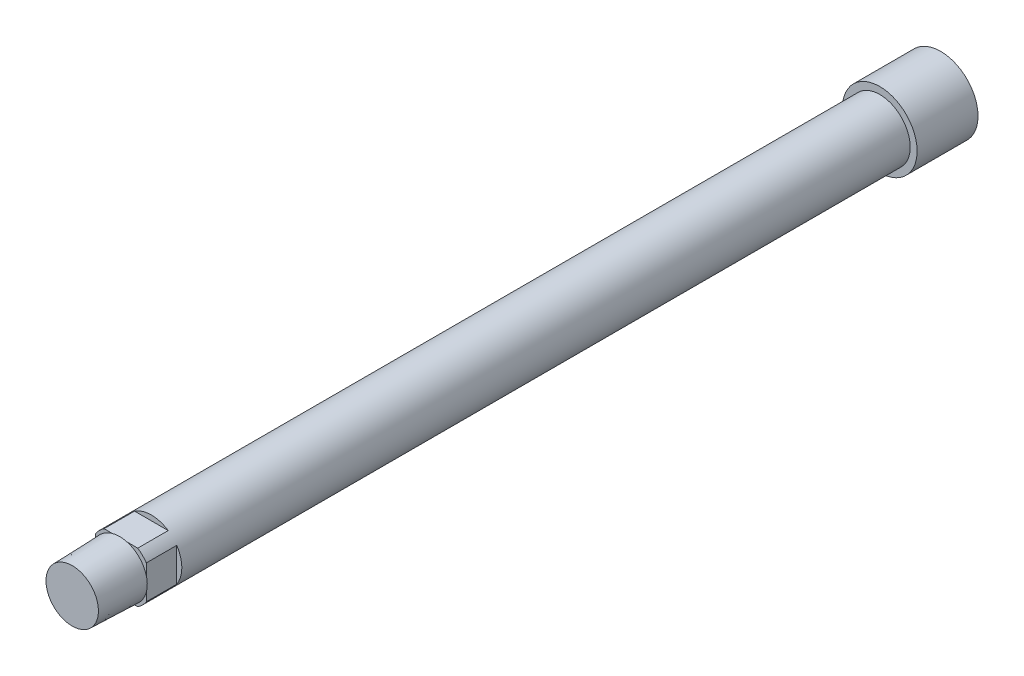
ISO-10303-21;
HEADER;
FILE_DESCRIPTION(('STEP AP214'),'2;1');
FILE_NAME('part.step','',(''),(''),'','','');
FILE_SCHEMA(('AUTOMOTIVE_DESIGN { 1 0 10303 214 1 1 1 1 }'));
ENDSEC;
DATA;
#1=APPLICATION_CONTEXT('core data for automotive mechanical design processes');
#2=APPLICATION_PROTOCOL_DEFINITION('international standard','automotive_design',2000,#1);
#3=PRODUCT_CONTEXT('',#1,'mechanical');
#4=PRODUCT('Part','Part','',(#3));
#5=PRODUCT_RELATED_PRODUCT_CATEGORY('part','',(#4));
#6=PRODUCT_DEFINITION_FORMATION('','',#4);
#7=PRODUCT_DEFINITION_CONTEXT('part definition',#1,'design');
#8=PRODUCT_DEFINITION('design','',#6,#7);
#9=PRODUCT_DEFINITION_SHAPE('','',#8);
#10=(LENGTH_UNIT() NAMED_UNIT(*) SI_UNIT(.MILLI.,.METRE.));
#11=(NAMED_UNIT(*) PLANE_ANGLE_UNIT() SI_UNIT($,.RADIAN.));
#12=(NAMED_UNIT(*) SI_UNIT($,.STERADIAN.) SOLID_ANGLE_UNIT());
#13=UNCERTAINTY_MEASURE_WITH_UNIT(LENGTH_MEASURE(1.E-05),#10,'distance_accuracy_value','');
#14=(GEOMETRIC_REPRESENTATION_CONTEXT(3) GLOBAL_UNCERTAINTY_ASSIGNED_CONTEXT((#13)) GLOBAL_UNIT_ASSIGNED_CONTEXT((#10,
#11,#12)) REPRESENTATION_CONTEXT('',''));
#15=CARTESIAN_POINT('',(0.,0.,0.));
#16=DIRECTION('',(0.,0.,1.));
#17=DIRECTION('',(1.,0.,0.));
#18=AXIS2_PLACEMENT_3D('',#15,#16,#17);
#19=CARTESIAN_POINT('',(0.,0.,227.8634));
#20=DIRECTION('',(0.,0.,1.));
#21=DIRECTION('',(1.,0.,0.));
#22=AXIS2_PLACEMENT_3D('',#19,#20,#21);
#23=PLANE('',#22);
#24=CARTESIAN_POINT('',(0.,0.,227.8634));
#25=DIRECTION('',(0.,0.,1.));
#26=DIRECTION('',(1.,0.,0.));
#27=AXIS2_PLACEMENT_3D('',#24,#25,#26);
#28=CIRCLE('',#27,9.525);
#29=CARTESIAN_POINT('',(-7.9375,5.2651418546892,227.8634));
#30=VERTEX_POINT('',#29);
#31=CARTESIAN_POINT('',(-7.9375,-5.2651418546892,227.8634));
#32=VERTEX_POINT('',#31);
#33=EDGE_CURVE('E11',#30,#32,#28,.T.);
#34=ORIENTED_EDGE('',*,*,#33,.T.);
#35=DIRECTION('',(0.,-1.,0.));
#36=VECTOR('',#35,1.);
#37=CARTESIAN_POINT('',(-7.9375,-7.93750000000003,227.8634));
#38=LINE('',#37,#36);
#39=EDGE_CURVE('E129',#30,#32,#38,.T.);
#40=ORIENTED_EDGE('',*,*,#39,.F.);
#41=EDGE_LOOP('',(#34,#40));
#42=FACE_BOUND('',#41,.T.);
#43=ADVANCED_FACE('F41',(#42),#23,.T.);
#44=CARTESIAN_POINT('',(-5.26514185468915,-7.93750000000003,227.8634));
#45=VERTEX_POINT('',#44);
#46=CARTESIAN_POINT('',(5.26514185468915,-7.93750000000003,227.8634));
#47=VERTEX_POINT('',#46);
#48=EDGE_CURVE('E45',#45,#47,#28,.T.);
#49=ORIENTED_EDGE('',*,*,#48,.T.);
#50=DIRECTION('',(1.,0.,0.));
#51=VECTOR('',#50,1.);
#52=CARTESIAN_POINT('',(-7.9375,-7.93750000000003,227.8634));
#53=LINE('',#52,#51);
#54=EDGE_CURVE('E184',#45,#47,#53,.T.);
#55=ORIENTED_EDGE('',*,*,#54,.F.);
#56=EDGE_LOOP('',(#49,#55));
#57=FACE_BOUND('',#56,.T.);
#58=ADVANCED_FACE('F226',(#57),#23,.T.);
#59=CARTESIAN_POINT('',(7.9375,-5.2651418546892,227.8634));
#60=VERTEX_POINT('',#59);
#61=CARTESIAN_POINT('',(7.9375,5.2651418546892,227.8634));
#62=VERTEX_POINT('',#61);
#63=EDGE_CURVE('E144',#60,#62,#28,.T.);
#64=ORIENTED_EDGE('',*,*,#63,.T.);
#65=DIRECTION('',(0.,1.,0.));
#66=VECTOR('',#65,1.);
#67=CARTESIAN_POINT('',(7.9375,-7.93750000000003,227.8634));
#68=LINE('',#67,#66);
#69=EDGE_CURVE('E181',#60,#62,#68,.T.);
#70=ORIENTED_EDGE('',*,*,#69,.F.);
#71=EDGE_LOOP('',(#64,#70));
#72=FACE_BOUND('',#71,.T.);
#73=ADVANCED_FACE('F232',(#72),#23,.T.);
#74=CARTESIAN_POINT('',(5.26514185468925,7.93749999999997,227.8634));
#75=VERTEX_POINT('',#74);
#76=CARTESIAN_POINT('',(-5.26514185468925,7.93749999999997,227.8634));
#77=VERTEX_POINT('',#76);
#78=EDGE_CURVE('E50',#75,#77,#28,.T.);
#79=ORIENTED_EDGE('',*,*,#78,.T.);
#80=DIRECTION('',(-1.,0.,0.));
#81=VECTOR('',#80,1.);
#82=CARTESIAN_POINT('',(-7.9375,7.93749999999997,227.8634));
#83=LINE('',#82,#81);
#84=EDGE_CURVE('E178',#75,#77,#83,.T.);
#85=ORIENTED_EDGE('',*,*,#84,.F.);
#86=EDGE_LOOP('',(#79,#85));
#87=FACE_BOUND('',#86,.T.);
#88=ADVANCED_FACE('F228',(#87),#23,.T.);
#89=CARTESIAN_POINT('',(-7.9375,-7.93750000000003,227.8634));
#90=DIRECTION('',(-1.,0.,0.));
#91=DIRECTION('',(0.,0.,1.));
#92=AXIS2_PLACEMENT_3D('',#89,#90,#91);
#93=PLANE('',#92);
#94=DIRECTION('',(0.,0.,-1.));
#95=VECTOR('',#94,1.);
#96=CARTESIAN_POINT('',(-7.9375,5.2651418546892,252.6284));
#97=LINE('',#96,#95);
#98=CARTESIAN_POINT('',(-7.9375,5.26514185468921,237.3884));
#99=VERTEX_POINT('',#98);
#100=EDGE_CURVE('E160',#99,#30,#97,.T.);
#101=ORIENTED_EDGE('',*,*,#100,.T.);
#102=ORIENTED_EDGE('',*,*,#39,.T.);
#103=DIRECTION('',(0.,0.,-1.));
#104=VECTOR('',#103,1.);
#105=CARTESIAN_POINT('',(-7.9375,-5.2651418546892,252.6284));
#106=LINE('',#105,#104);
#107=CARTESIAN_POINT('',(-7.9375,-5.26514185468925,237.3884));
#108=VERTEX_POINT('',#107);
#109=EDGE_CURVE('E137',#32,#108,#106,.F.);
#110=ORIENTED_EDGE('',*,*,#109,.T.);
#111=DIRECTION('',(0.,-1.,0.));
#112=VECTOR('',#111,1.);
#113=CARTESIAN_POINT('',(-7.9375,9.525,237.3884));
#114=LINE('',#113,#112);
#115=CARTESIAN_POINT('',(-7.9375,0.,237.3884));
#116=VERTEX_POINT('',#115);
#117=EDGE_CURVE('E64',#116,#108,#114,.T.);
#118=ORIENTED_EDGE('',*,*,#117,.F.);
#119=EDGE_CURVE('E133',#99,#116,#114,.T.);
#120=ORIENTED_EDGE('',*,*,#119,.F.);
#121=EDGE_LOOP('',(#101,#102,#110,#118,#120));
#122=FACE_BOUND('',#121,.T.);
#123=ADVANCED_FACE('F132',(#122),#93,.T.);
#124=CARTESIAN_POINT('',(-7.9375,7.93749999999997,227.8634));
#125=DIRECTION('',(0.,1.,0.));
#126=DIRECTION('',(0.,0.,1.));
#127=AXIS2_PLACEMENT_3D('',#124,#125,#126);
#128=PLANE('',#127);
#129=DIRECTION('',(0.,0.,-1.));
#130=VECTOR('',#129,1.);
#131=CARTESIAN_POINT('',(5.26514185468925,7.93749999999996,252.6284));
#132=LINE('',#131,#130);
#133=CARTESIAN_POINT('',(5.26514185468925,7.93749999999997,237.3884));
#134=VERTEX_POINT('',#133);
#135=EDGE_CURVE('E163',#134,#75,#132,.T.);
#136=ORIENTED_EDGE('',*,*,#135,.T.);
#137=ORIENTED_EDGE('',*,*,#84,.T.);
#138=DIRECTION('',(0.,0.,-1.));
#139=VECTOR('',#138,1.);
#140=CARTESIAN_POINT('',(-5.26514185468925,7.93749999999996,252.6284));
#141=LINE('',#140,#139);
#142=CARTESIAN_POINT('',(-5.26514185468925,7.93749999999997,237.3884));
#143=VERTEX_POINT('',#142);
#144=EDGE_CURVE('E165',#77,#143,#141,.F.);
#145=ORIENTED_EDGE('',*,*,#144,.T.);
#146=DIRECTION('',(-1.,0.,0.));
#147=VECTOR('',#146,1.);
#148=CARTESIAN_POINT('',(0.,7.93749999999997,237.3884));
#149=LINE('',#148,#147);
#150=CARTESIAN_POINT('',(0.,7.93749999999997,237.3884));
#151=VERTEX_POINT('',#150);
#152=EDGE_CURVE('E148',#151,#143,#149,.T.);
#153=ORIENTED_EDGE('',*,*,#152,.F.);
#154=EDGE_CURVE('E139',#134,#151,#149,.T.);
#155=ORIENTED_EDGE('',*,*,#154,.F.);
#156=EDGE_LOOP('',(#136,#137,#145,#153,#155));
#157=FACE_BOUND('',#156,.T.);
#158=ADVANCED_FACE('F242',(#157),#128,.T.);
#159=CARTESIAN_POINT('',(-7.9375,-7.93750000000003,227.8634));
#160=DIRECTION('',(0.,-1.,0.));
#161=DIRECTION('',(0.,0.,-1.));
#162=AXIS2_PLACEMENT_3D('',#159,#160,#161);
#163=PLANE('',#162);
#164=DIRECTION('',(0.,0.,-1.));
#165=VECTOR('',#164,1.);
#166=CARTESIAN_POINT('',(-5.26514185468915,-7.93750000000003,252.6284));
#167=LINE('',#166,#165);
#168=CARTESIAN_POINT('',(-5.26514185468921,-7.93750000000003,237.3884));
#169=VERTEX_POINT('',#168);
#170=EDGE_CURVE('E173',#169,#45,#167,.T.);
#171=ORIENTED_EDGE('',*,*,#170,.T.);
#172=ORIENTED_EDGE('',*,*,#54,.T.);
#173=DIRECTION('',(0.,0.,-1.));
#174=VECTOR('',#173,1.);
#175=CARTESIAN_POINT('',(5.26514185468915,-7.93750000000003,252.6284));
#176=LINE('',#175,#174);
#177=CARTESIAN_POINT('',(5.26514185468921,-7.93750000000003,237.3884));
#178=VERTEX_POINT('',#177);
#179=EDGE_CURVE('E175',#47,#178,#176,.F.);
#180=ORIENTED_EDGE('',*,*,#179,.T.);
#181=DIRECTION('',(1.,0.,0.));
#182=VECTOR('',#181,1.);
#183=CARTESIAN_POINT('',(0.,-7.93750000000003,237.3884));
#184=LINE('',#183,#182);
#185=CARTESIAN_POINT('',(0.,-7.93750000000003,237.3884));
#186=VERTEX_POINT('',#185);
#187=EDGE_CURVE('E154',#186,#178,#184,.T.);
#188=ORIENTED_EDGE('',*,*,#187,.F.);
#189=EDGE_CURVE('E128',#169,#186,#184,.T.);
#190=ORIENTED_EDGE('',*,*,#189,.F.);
#191=EDGE_LOOP('',(#171,#172,#180,#188,#190));
#192=FACE_BOUND('',#191,.T.);
#193=ADVANCED_FACE('F259',(#192),#163,.T.);
#194=CARTESIAN_POINT('',(7.9375,-7.93750000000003,227.8634));
#195=DIRECTION('',(1.,0.,0.));
#196=DIRECTION('',(0.,0.,-1.));
#197=AXIS2_PLACEMENT_3D('',#194,#195,#196);
#198=PLANE('',#197);
#199=DIRECTION('',(0.,0.,-1.));
#200=VECTOR('',#199,1.);
#201=CARTESIAN_POINT('',(7.9375,-5.2651418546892,252.6284));
#202=LINE('',#201,#200);
#203=CARTESIAN_POINT('',(7.9375,-5.26514185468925,237.3884));
#204=VERTEX_POINT('',#203);
#205=EDGE_CURVE('E168',#204,#60,#202,.T.);
#206=ORIENTED_EDGE('',*,*,#205,.T.);
#207=ORIENTED_EDGE('',*,*,#69,.T.);
#208=DIRECTION('',(0.,0.,-1.));
#209=VECTOR('',#208,1.);
#210=CARTESIAN_POINT('',(7.9375,5.2651418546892,252.6284));
#211=LINE('',#210,#209);
#212=CARTESIAN_POINT('',(7.9375,5.26514185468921,237.3884));
#213=VERTEX_POINT('',#212);
#214=EDGE_CURVE('E170',#62,#213,#211,.F.);
#215=ORIENTED_EDGE('',*,*,#214,.T.);
#216=DIRECTION('',(0.,1.,0.));
#217=VECTOR('',#216,1.);
#218=CARTESIAN_POINT('',(7.9375,9.525,237.3884));
#219=LINE('',#218,#217);
#220=CARTESIAN_POINT('',(7.9375,0.,237.3884));
#221=VERTEX_POINT('',#220);
#222=EDGE_CURVE('E152',#221,#213,#219,.T.);
#223=ORIENTED_EDGE('',*,*,#222,.F.);
#224=EDGE_CURVE('E149',#204,#221,#219,.T.);
#225=ORIENTED_EDGE('',*,*,#224,.F.);
#226=EDGE_LOOP('',(#206,#207,#215,#223,#225));
#227=FACE_BOUND('',#226,.T.);
#228=ADVANCED_FACE('F265',(#227),#198,.T.);
#229=CARTESIAN_POINT('',(0.,9.525,237.3884));
#230=DIRECTION('',(0.,0.,1.));
#231=DIRECTION('',(0.,-1.,0.));
#232=AXIS2_PLACEMENT_3D('',#229,#230,#231);
#233=PLANE('',#232);
#234=ORIENTED_EDGE('',*,*,#189,.T.);
#235=CARTESIAN_POINT('',(0.,0.,237.3884));
#236=DIRECTION('',(0.,0.,1.));
#237=DIRECTION('',(0.,-1.,0.));
#238=AXIS2_PLACEMENT_3D('',#235,#236,#237);
#239=CIRCLE('',#238,7.93749999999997);
#240=EDGE_CURVE('E57',#186,#116,#239,.F.);
#241=ORIENTED_EDGE('',*,*,#240,.T.);
#242=ORIENTED_EDGE('',*,*,#117,.T.);
#243=CARTESIAN_POINT('',(0.,0.,237.3884));
#244=DIRECTION('',(0.,0.,1.));
#245=DIRECTION('',(0.,-1.,0.));
#246=AXIS2_PLACEMENT_3D('',#243,#244,#245);
#247=CIRCLE('',#246,9.52500000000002);
#248=EDGE_CURVE('E159',#108,#169,#247,.T.);
#249=ORIENTED_EDGE('',*,*,#248,.T.);
#250=EDGE_LOOP('',(#234,#241,#242,#249));
#251=FACE_BOUND('',#250,.T.);
#252=ADVANCED_FACE('F127',(#251),#233,.T.);
#253=ORIENTED_EDGE('',*,*,#224,.T.);
#254=EDGE_CURVE('E130',#221,#186,#239,.F.);
#255=ORIENTED_EDGE('',*,*,#254,.T.);
#256=ORIENTED_EDGE('',*,*,#187,.T.);
#257=EDGE_CURVE('E155',#178,#204,#247,.T.);
#258=ORIENTED_EDGE('',*,*,#257,.T.);
#259=EDGE_LOOP('',(#253,#255,#256,#258));
#260=FACE_BOUND('',#259,.T.);
#261=ADVANCED_FACE('F263',(#260),#233,.T.);
#262=ORIENTED_EDGE('',*,*,#154,.T.);
#263=EDGE_CURVE('E121',#151,#221,#239,.F.);
#264=ORIENTED_EDGE('',*,*,#263,.T.);
#265=ORIENTED_EDGE('',*,*,#222,.T.);
#266=EDGE_CURVE('E158',#213,#134,#247,.T.);
#267=ORIENTED_EDGE('',*,*,#266,.T.);
#268=EDGE_LOOP('',(#262,#264,#265,#267));
#269=FACE_BOUND('',#268,.T.);
#270=ADVANCED_FACE('F252',(#269),#233,.T.);
#271=ORIENTED_EDGE('',*,*,#119,.T.);
#272=EDGE_CURVE('E117',#116,#151,#239,.F.);
#273=ORIENTED_EDGE('',*,*,#272,.T.);
#274=ORIENTED_EDGE('',*,*,#152,.T.);
#275=EDGE_CURVE('E143',#143,#99,#247,.T.);
#276=ORIENTED_EDGE('',*,*,#275,.T.);
#277=EDGE_LOOP('',(#271,#273,#274,#276));
#278=FACE_BOUND('',#277,.T.);
#279=ADVANCED_FACE('F141',(#278),#233,.T.);
#280=CARTESIAN_POINT('',(0.,0.,252.6284));
#281=DIRECTION('',(0.,0.,-1.));
#282=DIRECTION('',(-1.,0.,0.));
#283=AXIS2_PLACEMENT_3D('',#280,#281,#282);
#284=CYLINDRICAL_SURFACE('',#283,9.525);
#285=CARTESIAN_POINT('',(0.,0.,0.));
#286=DIRECTION('',(0.,0.,-1.));
#287=DIRECTION('',(-1.,0.,0.));
#288=AXIS2_PLACEMENT_3D('',#285,#286,#287);
#289=CIRCLE('',#288,9.525);
#290=CARTESIAN_POINT('',(-9.525,0.,0.));
#291=VERTEX_POINT('',#290);
#292=EDGE_CURVE('E194',#291,#291,#289,.T.);
#293=ORIENTED_EDGE('',*,*,#292,.F.);
#294=EDGE_LOOP('',(#293));
#295=FACE_BOUND('',#294,.T.);
#296=ORIENTED_EDGE('',*,*,#100,.F.);
#297=ORIENTED_EDGE('',*,*,#275,.F.);
#298=ORIENTED_EDGE('',*,*,#144,.F.);
#299=ORIENTED_EDGE('',*,*,#78,.F.);
#300=ORIENTED_EDGE('',*,*,#135,.F.);
#301=ORIENTED_EDGE('',*,*,#266,.F.);
#302=ORIENTED_EDGE('',*,*,#214,.F.);
#303=ORIENTED_EDGE('',*,*,#63,.F.);
#304=ORIENTED_EDGE('',*,*,#205,.F.);
#305=ORIENTED_EDGE('',*,*,#257,.F.);
#306=ORIENTED_EDGE('',*,*,#179,.F.);
#307=ORIENTED_EDGE('',*,*,#48,.F.);
#308=ORIENTED_EDGE('',*,*,#170,.F.);
#309=ORIENTED_EDGE('',*,*,#248,.F.);
#310=ORIENTED_EDGE('',*,*,#109,.F.);
#311=ORIENTED_EDGE('',*,*,#33,.F.);
#312=EDGE_LOOP('',(#296,#297,#298,#299,#300,#301,#302,#303,#304,#305,#306,#307,#308,#309,#310,#311));
#313=FACE_BOUND('',#312,.T.);
#314=ADVANCED_FACE('F43',(#295,#313),#284,.T.);
#315=CARTESIAN_POINT('',(0.,0.,236.470198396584));
#316=DIRECTION('',(0.,0.,1.));
#317=DIRECTION('',(0.,-1.,0.));
#318=AXIS2_PLACEMENT_3D('',#315,#316,#317);
#319=CONICAL_SURFACE('',#318,6.35,1.04641457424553);
#320=ORIENTED_EDGE('',*,*,#240,.F.);
#321=ORIENTED_EDGE('',*,*,#254,.F.);
#322=ORIENTED_EDGE('',*,*,#263,.F.);
#323=ORIENTED_EDGE('',*,*,#272,.F.);
#324=EDGE_LOOP('',(#320,#321,#322,#323));
#325=FACE_BOUND('',#324,.T.);
#326=CARTESIAN_POINT('',(0.,0.,237.808996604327));
#327=DIRECTION('',(0.,0.,1.));
#328=DIRECTION('',(0.,-1.,0.));
#329=AXIS2_PLACEMENT_3D('',#326,#327,#328);
#330=CIRCLE('',#329,8.66467920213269);
#331=CARTESIAN_POINT('',(0.,-8.66467920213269,237.808996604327));
#332=VERTEX_POINT('',#331);
#333=EDGE_CURVE('E188',#332,#332,#330,.T.);
#334=ORIENTED_EDGE('',*,*,#333,.F.);
#335=EDGE_LOOP('',(#334));
#336=FACE_BOUND('',#335,.T.);
#337=ADVANCED_FACE('F118',(#325,#336),#319,.T.);
#338=CARTESIAN_POINT('',(0.,0.,252.6284));
#339=DIRECTION('',(0.,0.,-1.));
#340=DIRECTION('',(0.,1.,0.));
#341=AXIS2_PLACEMENT_3D('',#338,#339,#340);
#342=CONICAL_SURFACE('',#341,8.20413868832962,0.0310668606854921);
#343=ORIENTED_EDGE('',*,*,#333,.T.);
#344=EDGE_LOOP('',(#343));
#345=FACE_BOUND('',#344,.T.);
#346=CARTESIAN_POINT('',(0.,0.,252.6284));
#347=DIRECTION('',(0.,0.,1.));
#348=DIRECTION('',(0.,-1.,0.));
#349=AXIS2_PLACEMENT_3D('',#346,#347,#348);
#350=CIRCLE('',#349,8.20413868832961);
#351=CARTESIAN_POINT('',(0.,-8.20413868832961,252.6284));
#352=VERTEX_POINT('',#351);
#353=EDGE_CURVE('E191',#352,#352,#350,.T.);
#354=ORIENTED_EDGE('',*,*,#353,.F.);
#355=EDGE_LOOP('',(#354));
#356=FACE_BOUND('',#355,.T.);
#357=ADVANCED_FACE('F281',(#345,#356),#342,.T.);
#358=CARTESIAN_POINT('',(0.,0.,252.6284));
#359=DIRECTION('',(0.,0.,1.));
#360=DIRECTION('',(1.,0.,0.));
#361=AXIS2_PLACEMENT_3D('',#358,#359,#360);
#362=PLANE('',#361);
#363=ORIENTED_EDGE('',*,*,#353,.T.);
#364=EDGE_LOOP('',(#363));
#365=FACE_BOUND('',#364,.T.);
#366=ADVANCED_FACE('F215',(#365),#362,.T.);
#367=CARTESIAN_POINT('',(0.,0.,0.));
#368=DIRECTION('',(0.,0.,-1.));
#369=DIRECTION('',(-1.,0.,0.));
#370=AXIS2_PLACEMENT_3D('',#367,#368,#369);
#371=PLANE('',#370);
#372=CARTESIAN_POINT('',(0.,0.,0.));
#373=DIRECTION('',(0.,0.,-1.));
#374=DIRECTION('',(-1.,0.,0.));
#375=AXIS2_PLACEMENT_3D('',#372,#373,#374);
#376=CIRCLE('',#375,11.684);
#377=CARTESIAN_POINT('',(11.684,0.,0.));
#378=VERTEX_POINT('',#377);
#379=EDGE_CURVE('E198',#378,#378,#376,.T.);
#380=ORIENTED_EDGE('',*,*,#379,.F.);
#381=EDGE_LOOP('',(#380));
#382=FACE_BOUND('',#381,.T.);
#383=ORIENTED_EDGE('',*,*,#292,.T.);
#384=EDGE_LOOP('',(#383));
#385=FACE_BOUND('',#384,.T.);
#386=ADVANCED_FACE('F209',(#382,#385),#371,.F.);
#387=CARTESIAN_POINT('',(0.,0.,-19.05));
#388=DIRECTION('',(0.,0.,1.));
#389=DIRECTION('',(1.,0.,0.));
#390=AXIS2_PLACEMENT_3D('',#387,#388,#389);
#391=CYLINDRICAL_SURFACE('',#390,11.684);
#392=CARTESIAN_POINT('',(0.,0.,-19.05));
#393=DIRECTION('',(0.,0.,-1.));
#394=DIRECTION('',(-1.,0.,0.));
#395=AXIS2_PLACEMENT_3D('',#392,#393,#394);
#396=CIRCLE('',#395,11.684);
#397=CARTESIAN_POINT('',(11.684,0.,-19.05));
#398=VERTEX_POINT('',#397);
#399=EDGE_CURVE('E197',#398,#398,#396,.T.);
#400=CARTESIAN_POINT('',(11.684,0.,-19.05));
#401=CARTESIAN_POINT('',(11.684,0.,-18.8515625));
#402=CARTESIAN_POINT('',(11.684,0.,-18.653125));
#403=CARTESIAN_POINT('',(11.684,0.,-18.25625));
#404=CARTESIAN_POINT('',(11.684,0.,-18.0578125));
#405=CARTESIAN_POINT('',(11.684,0.,-17.6609375));
#406=CARTESIAN_POINT('',(11.684,0.,-17.4625));
#407=CARTESIAN_POINT('',(11.684,0.,-17.065625));
#408=CARTESIAN_POINT('',(11.684,0.,-16.8671875));
#409=CARTESIAN_POINT('',(11.684,0.,-16.4703125));
#410=CARTESIAN_POINT('',(11.684,0.,-16.271875));
#411=CARTESIAN_POINT('',(11.684,0.,-15.875));
#412=CARTESIAN_POINT('',(11.684,0.,-15.6765625));
#413=CARTESIAN_POINT('',(11.684,0.,-15.2796875));
#414=CARTESIAN_POINT('',(11.684,0.,-15.08125));
#415=CARTESIAN_POINT('',(11.684,0.,-14.684375));
#416=CARTESIAN_POINT('',(11.684,0.,-14.4859375));
#417=CARTESIAN_POINT('',(11.684,0.,-14.0890625));
#418=CARTESIAN_POINT('',(11.684,0.,-13.890625));
#419=CARTESIAN_POINT('',(11.684,0.,-13.49375));
#420=CARTESIAN_POINT('',(11.684,0.,-13.2953125));
#421=CARTESIAN_POINT('',(11.684,0.,-12.8984375));
#422=CARTESIAN_POINT('',(11.684,0.,-12.7));
#423=CARTESIAN_POINT('',(11.684,0.,-12.303125));
#424=CARTESIAN_POINT('',(11.684,0.,-12.1046875));
#425=CARTESIAN_POINT('',(11.684,0.,-11.7078125));
#426=CARTESIAN_POINT('',(11.684,0.,-11.509375));
#427=CARTESIAN_POINT('',(11.684,0.,-11.1125));
#428=CARTESIAN_POINT('',(11.684,0.,-10.9140625));
#429=CARTESIAN_POINT('',(11.684,0.,-10.5171875));
#430=CARTESIAN_POINT('',(11.684,0.,-10.31875));
#431=CARTESIAN_POINT('',(11.684,0.,-9.921875));
#432=CARTESIAN_POINT('',(11.684,0.,-9.7234375));
#433=CARTESIAN_POINT('',(11.684,0.,-9.3265625));
#434=CARTESIAN_POINT('',(11.684,0.,-9.128125));
#435=CARTESIAN_POINT('',(11.684,0.,-8.73125));
#436=CARTESIAN_POINT('',(11.684,0.,-8.5328125));
#437=CARTESIAN_POINT('',(11.684,0.,-8.1359375));
#438=CARTESIAN_POINT('',(11.684,0.,-7.9375));
#439=CARTESIAN_POINT('',(11.684,0.,-7.540625));
#440=CARTESIAN_POINT('',(11.684,0.,-7.3421875));
#441=CARTESIAN_POINT('',(11.684,0.,-6.9453125));
#442=CARTESIAN_POINT('',(11.684,0.,-6.746875));
#443=CARTESIAN_POINT('',(11.684,0.,-6.35));
#444=CARTESIAN_POINT('',(11.684,0.,-6.1515625));
#445=CARTESIAN_POINT('',(11.684,0.,-5.7546875));
#446=CARTESIAN_POINT('',(11.684,0.,-5.55625));
#447=CARTESIAN_POINT('',(11.684,0.,-5.159375));
#448=CARTESIAN_POINT('',(11.684,0.,-4.9609375));
#449=CARTESIAN_POINT('',(11.684,0.,-4.5640625));
#450=CARTESIAN_POINT('',(11.684,0.,-4.365625));
#451=CARTESIAN_POINT('',(11.684,0.,-3.96875));
#452=CARTESIAN_POINT('',(11.684,0.,-3.7703125));
#453=CARTESIAN_POINT('',(11.684,0.,-3.3734375));
#454=CARTESIAN_POINT('',(11.684,0.,-3.175));
#455=CARTESIAN_POINT('',(11.684,0.,-2.778125));
#456=CARTESIAN_POINT('',(11.684,0.,-2.5796875));
#457=CARTESIAN_POINT('',(11.684,0.,-2.1828125));
#458=CARTESIAN_POINT('',(11.684,0.,-1.984375));
#459=CARTESIAN_POINT('',(11.684,0.,-1.5875));
#460=CARTESIAN_POINT('',(11.684,0.,-1.3890625));
#461=CARTESIAN_POINT('',(11.684,0.,-0.992187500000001));
#462=CARTESIAN_POINT('',(11.684,0.,-0.793750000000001));
#463=CARTESIAN_POINT('',(11.684,0.,-0.396875));
#464=CARTESIAN_POINT('',(11.684,0.,-0.1984375));
#465=CARTESIAN_POINT('',(11.684,0.,0.));
#466=B_SPLINE_CURVE_WITH_KNOTS('',3,(#400,#401,#402,#403,#404,#405,#406,#407,#408,#409,#410,
#411,#412,#413,#414,#415,#416,#417,#418,#419,#420,#421,#422,#423,#424,#425,#426,#427,#428,#429,
#430,#431,#432,#433,#434,#435,#436,#437,#438,#439,#440,#441,#442,#443,#444,#445,#446,#447,#448,
#449,#450,#451,#452,#453,#454,#455,#456,#457,#458,#459,#460,#461,#462,#463,#464,#465),
.UNSPECIFIED.,.F.,.F.,(4,2,2,2,2,2,2,2,2,2,2,2,2,2,2,2,2,2,2,2,2,2,2,2,2,2,2,2,2,2,2,2,4),(0.,
0.595312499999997,1.190625,1.7859375,2.38125,2.9765625,3.571875,4.1671875,4.7625,5.3578125,
5.953125,6.5484375,7.14375,7.7390625,8.334375,8.9296875,9.525,10.1203125,10.715625,11.3109375,
11.90625,12.5015625,13.096875,13.6921875,14.2875,14.8828125,15.478125,16.0734375,16.66875,
17.2640625,17.859375,18.4546875,19.05),.UNSPECIFIED.);
#467=EDGE_CURVE('BSEAM206',#398,#378,#466,.T.);
#468=ORIENTED_EDGE('',*,*,#399,.F.);
#469=ORIENTED_EDGE('',*,*,#379,.T.);
#470=ORIENTED_EDGE('',*,*,#467,.T.);
#471=ORIENTED_EDGE('',*,*,#467,.F.);
#472=EDGE_LOOP('',(#468,#470,#469,#471));
#473=FACE_BOUND('',#472,.T.);
#474=ADVANCED_FACE('F206',(#473),#391,.T.);
#475=CARTESIAN_POINT('',(0.,0.,-19.05));
#476=DIRECTION('',(0.,0.,-1.));
#477=DIRECTION('',(-1.,0.,0.));
#478=AXIS2_PLACEMENT_3D('',#475,#476,#477);
#479=PLANE('',#478);
#480=ORIENTED_EDGE('',*,*,#399,.T.);
#481=EDGE_LOOP('',(#480));
#482=FACE_BOUND('',#481,.T.);
#483=ADVANCED_FACE('F204',(#482),#479,.T.);
#484=CLOSED_SHELL('',(#43,#58,#73,#88,#123,#158,#193,#228,#252,#261,#270,#279,#314,#337,#357,
#366,#386,#474,#483));
#485=MANIFOLD_SOLID_BREP('B2',#484);
#486=ADVANCED_BREP_SHAPE_REPRESENTATION('',(#18,#485),#14);
#487=SHAPE_DEFINITION_REPRESENTATION(#9,#486);
ENDSEC;
END-ISO-10303-21;
